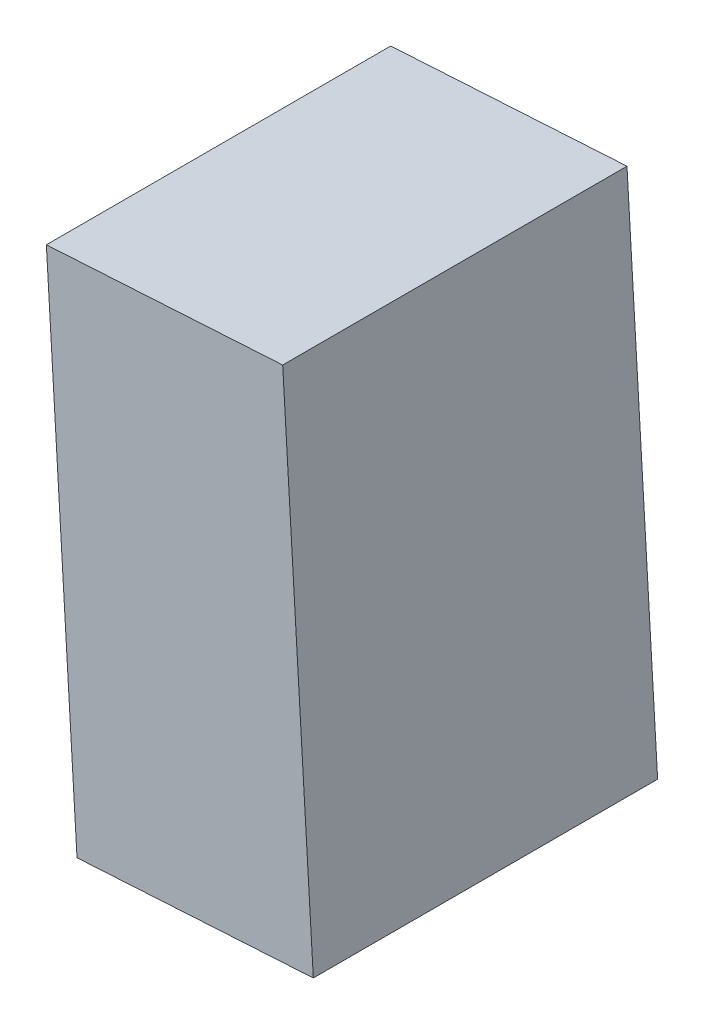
ISO-10303-21;
HEADER;
FILE_DESCRIPTION(('STEP AP214'),'2;1');
FILE_NAME('part.step','',(''),(''),'','','');
FILE_SCHEMA(('AUTOMOTIVE_DESIGN { 1 0 10303 214 1 1 1 1 }'));
ENDSEC;
DATA;
#1=APPLICATION_CONTEXT('core data for automotive mechanical design processes');
#2=APPLICATION_PROTOCOL_DEFINITION('international standard','automotive_design',2000,#1);
#3=PRODUCT_CONTEXT('',#1,'mechanical');
#4=PRODUCT('Part','Part','',(#3));
#5=PRODUCT_RELATED_PRODUCT_CATEGORY('part','',(#4));
#6=PRODUCT_DEFINITION_FORMATION('','',#4);
#7=PRODUCT_DEFINITION_CONTEXT('part definition',#1,'design');
#8=PRODUCT_DEFINITION('design','',#6,#7);
#9=PRODUCT_DEFINITION_SHAPE('','',#8);
#10=(LENGTH_UNIT() NAMED_UNIT(*) SI_UNIT(.MILLI.,.METRE.));
#11=(NAMED_UNIT(*) PLANE_ANGLE_UNIT() SI_UNIT($,.RADIAN.));
#12=(NAMED_UNIT(*) SI_UNIT($,.STERADIAN.) SOLID_ANGLE_UNIT());
#13=UNCERTAINTY_MEASURE_WITH_UNIT(LENGTH_MEASURE(1.E-05),#10,'distance_accuracy_value','');
#14=(GEOMETRIC_REPRESENTATION_CONTEXT(3) GLOBAL_UNCERTAINTY_ASSIGNED_CONTEXT((#13)) GLOBAL_UNIT_ASSIGNED_CONTEXT((#10,
#11,#12)) REPRESENTATION_CONTEXT('',''));
#15=CARTESIAN_POINT('',(0.,0.,0.));
#16=DIRECTION('',(0.,0.,1.));
#17=DIRECTION('',(1.,0.,0.));
#18=AXIS2_PLACEMENT_3D('',#15,#16,#17);
#19=CARTESIAN_POINT('',(-520.471063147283,49.789583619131,-406.4));
#20=DIRECTION('',(-0.0593278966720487,0.998238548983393,0.));
#21=DIRECTION('',(-0.998238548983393,-0.0593278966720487,0.));
#22=AXIS2_PLACEMENT_3D('',#19,#20,#21);
#23=PLANE('',#22);
#24=DIRECTION('',(-0.998238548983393,-0.0593278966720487,0.));
#25=VECTOR('',#24,1.);
#26=CARTESIAN_POINT('',(-520.471063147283,49.789583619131,0.));
#27=LINE('',#26,#25);
#28=CARTESIAN_POINT('',(-520.471063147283,49.789583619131,0.));
#29=VERTEX_POINT('',#28);
#30=CARTESIAN_POINT('',(-799.378913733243,33.2133692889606,0.));
#31=VERTEX_POINT('',#30);
#32=EDGE_CURVE('E97',#29,#31,#27,.T.);
#33=ORIENTED_EDGE('',*,*,#32,.F.);
#34=DIRECTION('',(0.,0.,1.));
#35=VECTOR('',#34,1.);
#36=CARTESIAN_POINT('',(-520.471063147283,49.789583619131,-406.4));
#37=LINE('',#36,#35);
#38=CARTESIAN_POINT('',(-520.471063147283,49.789583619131,-406.4));
#39=VERTEX_POINT('',#38);
#40=EDGE_CURVE('E11',#39,#29,#37,.T.);
#41=ORIENTED_EDGE('',*,*,#40,.F.);
#42=DIRECTION('',(-0.998238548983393,-0.0593278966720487,0.));
#43=VECTOR('',#42,1.);
#44=CARTESIAN_POINT('',(-520.471063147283,49.789583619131,-406.4));
#45=LINE('',#44,#43);
#46=CARTESIAN_POINT('',(-799.378913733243,33.2133692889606,-406.4));
#47=VERTEX_POINT('',#46);
#48=EDGE_CURVE('E91',#39,#47,#45,.T.);
#49=ORIENTED_EDGE('',*,*,#48,.T.);
#50=DIRECTION('',(0.,0.,1.));
#51=VECTOR('',#50,1.);
#52=CARTESIAN_POINT('',(-799.378913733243,33.2133692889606,-406.4));
#53=LINE('',#52,#51);
#54=EDGE_CURVE('E36',#47,#31,#53,.T.);
#55=ORIENTED_EDGE('',*,*,#54,.T.);
#56=EDGE_LOOP('',(#33,#41,#49,#55));
#57=FACE_BOUND('',#56,.T.);
#58=ADVANCED_FACE('F33',(#57),#23,.T.);
#59=CARTESIAN_POINT('',(-484.304777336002,-558.736635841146,-406.4));
#60=DIRECTION('',(0.998238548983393,0.0593278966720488,0.));
#61=DIRECTION('',(-0.0593278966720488,0.998238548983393,0.));
#62=AXIS2_PLACEMENT_3D('',#59,#60,#61);
#63=PLANE('',#62);
#64=DIRECTION('',(-0.0593278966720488,0.998238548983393,0.));
#65=VECTOR('',#64,1.);
#66=CARTESIAN_POINT('',(-484.304777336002,-558.736635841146,0.));
#67=LINE('',#66,#65);
#68=CARTESIAN_POINT('',(-484.304777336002,-558.736635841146,0.));
#69=VERTEX_POINT('',#68);
#70=EDGE_CURVE('E93',#69,#29,#67,.T.);
#71=ORIENTED_EDGE('',*,*,#70,.F.);
#72=DIRECTION('',(0.,0.,1.));
#73=VECTOR('',#72,1.);
#74=CARTESIAN_POINT('',(-484.304777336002,-558.736635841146,-406.4));
#75=LINE('',#74,#73);
#76=CARTESIAN_POINT('',(-484.304777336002,-558.736635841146,-406.4));
#77=VERTEX_POINT('',#76);
#78=EDGE_CURVE('E42',#77,#69,#75,.T.);
#79=ORIENTED_EDGE('',*,*,#78,.F.);
#80=DIRECTION('',(-0.0593278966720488,0.998238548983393,0.));
#81=VECTOR('',#80,1.);
#82=CARTESIAN_POINT('',(-484.304777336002,-558.736635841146,-406.4));
#83=LINE('',#82,#81);
#84=EDGE_CURVE('E88',#77,#39,#83,.T.);
#85=ORIENTED_EDGE('',*,*,#84,.T.);
#86=ORIENTED_EDGE('',*,*,#40,.T.);
#87=EDGE_LOOP('',(#71,#79,#85,#86));
#88=FACE_BOUND('',#87,.T.);
#89=ADVANCED_FACE('F107',(#88),#63,.T.);
#90=CARTESIAN_POINT('',(-763.212627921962,-575.312850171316,-406.4));
#91=DIRECTION('',(0.059327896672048,-0.998238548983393,0.));
#92=DIRECTION('',(0.998238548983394,0.059327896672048,0.));
#93=AXIS2_PLACEMENT_3D('',#90,#91,#92);
#94=PLANE('',#93);
#95=DIRECTION('',(0.998238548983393,0.059327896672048,0.));
#96=VECTOR('',#95,1.);
#97=CARTESIAN_POINT('',(-763.212627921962,-575.312850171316,0.));
#98=LINE('',#97,#96);
#99=CARTESIAN_POINT('',(-763.212627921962,-575.312850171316,0.));
#100=VERTEX_POINT('',#99);
#101=EDGE_CURVE('E83',#100,#69,#98,.T.);
#102=ORIENTED_EDGE('',*,*,#101,.F.);
#103=DIRECTION('',(0.,0.,1.));
#104=VECTOR('',#103,1.);
#105=CARTESIAN_POINT('',(-763.212627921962,-575.312850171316,-406.4));
#106=LINE('',#105,#104);
#107=CARTESIAN_POINT('',(-763.212627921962,-575.312850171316,-406.4));
#108=VERTEX_POINT('',#107);
#109=EDGE_CURVE('E78',#108,#100,#106,.T.);
#110=ORIENTED_EDGE('',*,*,#109,.F.);
#111=DIRECTION('',(0.998238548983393,0.059327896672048,0.));
#112=VECTOR('',#111,1.);
#113=CARTESIAN_POINT('',(-763.212627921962,-575.312850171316,-406.4));
#114=LINE('',#113,#112);
#115=EDGE_CURVE('E81',#108,#77,#114,.T.);
#116=ORIENTED_EDGE('',*,*,#115,.T.);
#117=ORIENTED_EDGE('',*,*,#78,.T.);
#118=EDGE_LOOP('',(#102,#110,#116,#117));
#119=FACE_BOUND('',#118,.T.);
#120=ADVANCED_FACE('F80',(#119),#94,.T.);
#121=CARTESIAN_POINT('',(-799.378913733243,33.2133692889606,-406.4));
#122=DIRECTION('',(-0.998238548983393,-0.0593278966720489,0.));
#123=DIRECTION('',(0.0593278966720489,-0.998238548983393,0.));
#124=AXIS2_PLACEMENT_3D('',#121,#122,#123);
#125=PLANE('',#124);
#126=DIRECTION('',(0.0593278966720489,-0.998238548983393,0.));
#127=VECTOR('',#126,1.);
#128=CARTESIAN_POINT('',(-799.378913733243,33.2133692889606,0.));
#129=LINE('',#128,#127);
#130=EDGE_CURVE('E100',#31,#100,#129,.T.);
#131=ORIENTED_EDGE('',*,*,#130,.F.);
#132=ORIENTED_EDGE('',*,*,#54,.F.);
#133=DIRECTION('',(0.0593278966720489,-0.998238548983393,0.));
#134=VECTOR('',#133,1.);
#135=CARTESIAN_POINT('',(-799.378913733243,33.2133692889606,-406.4));
#136=LINE('',#135,#134);
#137=EDGE_CURVE('E87',#47,#108,#136,.T.);
#138=ORIENTED_EDGE('',*,*,#137,.T.);
#139=ORIENTED_EDGE('',*,*,#109,.T.);
#140=EDGE_LOOP('',(#131,#132,#138,#139));
#141=FACE_BOUND('',#140,.T.);
#142=ADVANCED_FACE('F90',(#141),#125,.T.);
#143=CARTESIAN_POINT('',(0.,0.,-406.4));
#144=DIRECTION('',(0.,0.,1.));
#145=DIRECTION('',(1.,0.,0.));
#146=AXIS2_PLACEMENT_3D('',#143,#144,#145);
#147=PLANE('',#146);
#148=ORIENTED_EDGE('',*,*,#48,.F.);
#149=ORIENTED_EDGE('',*,*,#84,.F.);
#150=ORIENTED_EDGE('',*,*,#115,.F.);
#151=ORIENTED_EDGE('',*,*,#137,.F.);
#152=EDGE_LOOP('',(#148,#149,#150,#151));
#153=FACE_BOUND('',#152,.T.);
#154=ADVANCED_FACE('F86',(#153),#147,.F.);
#155=CARTESIAN_POINT('',(0.,0.,0.));
#156=DIRECTION('',(0.,0.,1.));
#157=DIRECTION('',(1.,0.,0.));
#158=AXIS2_PLACEMENT_3D('',#155,#156,#157);
#159=PLANE('',#158);
#160=ORIENTED_EDGE('',*,*,#32,.T.);
#161=ORIENTED_EDGE('',*,*,#130,.T.);
#162=ORIENTED_EDGE('',*,*,#101,.T.);
#163=ORIENTED_EDGE('',*,*,#70,.T.);
#164=EDGE_LOOP('',(#160,#161,#162,#163));
#165=FACE_BOUND('',#164,.T.);
#166=ADVANCED_FACE('F106',(#165),#159,.T.);
#167=CLOSED_SHELL('',(#58,#89,#120,#142,#154,#166));
#168=MANIFOLD_SOLID_BREP('B2',#167);
#169=ADVANCED_BREP_SHAPE_REPRESENTATION('',(#18,#168),#14);
#170=SHAPE_DEFINITION_REPRESENTATION(#9,#169);
ENDSEC;
END-ISO-10303-21;
